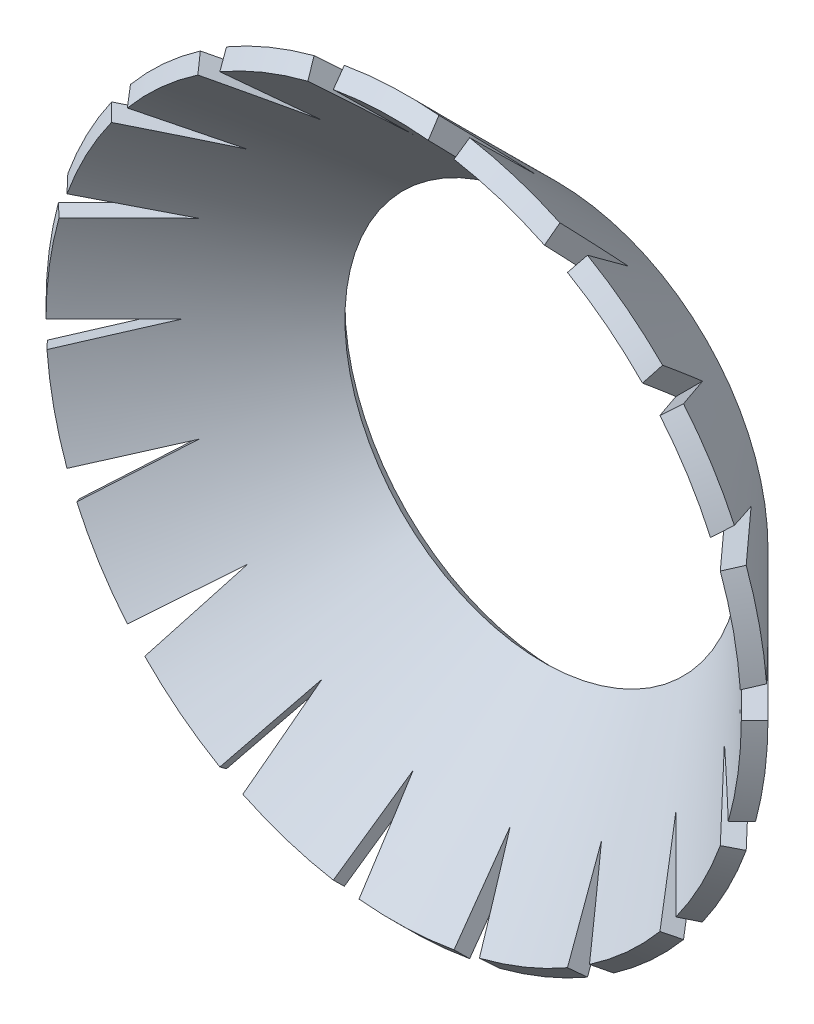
from build123d import *

# Parameters (mm, degrees)
TOOTHCUT_DEPTH = 12.272794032
TOOTHPAT_COUNT = 18


with BuildPart() as part:
    # BodySke → BaseBody (revolve)
    with BuildSketch(Plane(origin=(0, 0, 0), x_dir=(1, 0, 0), z_dir=(0, 1, 0))):
        Polygon((7.65, 0), (4.482842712, 3.167157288), (4.2, 2.884314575), (7.367157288, -0.282842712), align=None)
    revolve(axis=Axis((0, 0, 1.599979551), (0, 0, -1)))

    # ToothSke → ToothCut (cut, symmetric)
    with BuildSketch(Plane.XY):
        Polygon((7.65, 0), (7.65, 0.667588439), (5.925, 0), align=None)
    toothcut = extrude(amount=TOOTHCUT_DEPTH, both=True, mode=Mode.SUBTRACT)

    # ToothPat: ToothCut ×18 about axis
    toothpat_axis = Axis((0, 0, 0), (0, 0, 1))
    for i in range(1, TOOTHPAT_COUNT):
        add(toothcut.rotate(toothpat_axis, i * 360 / TOOTHPAT_COUNT), mode=Mode.SUBTRACT)


solid = part.part
